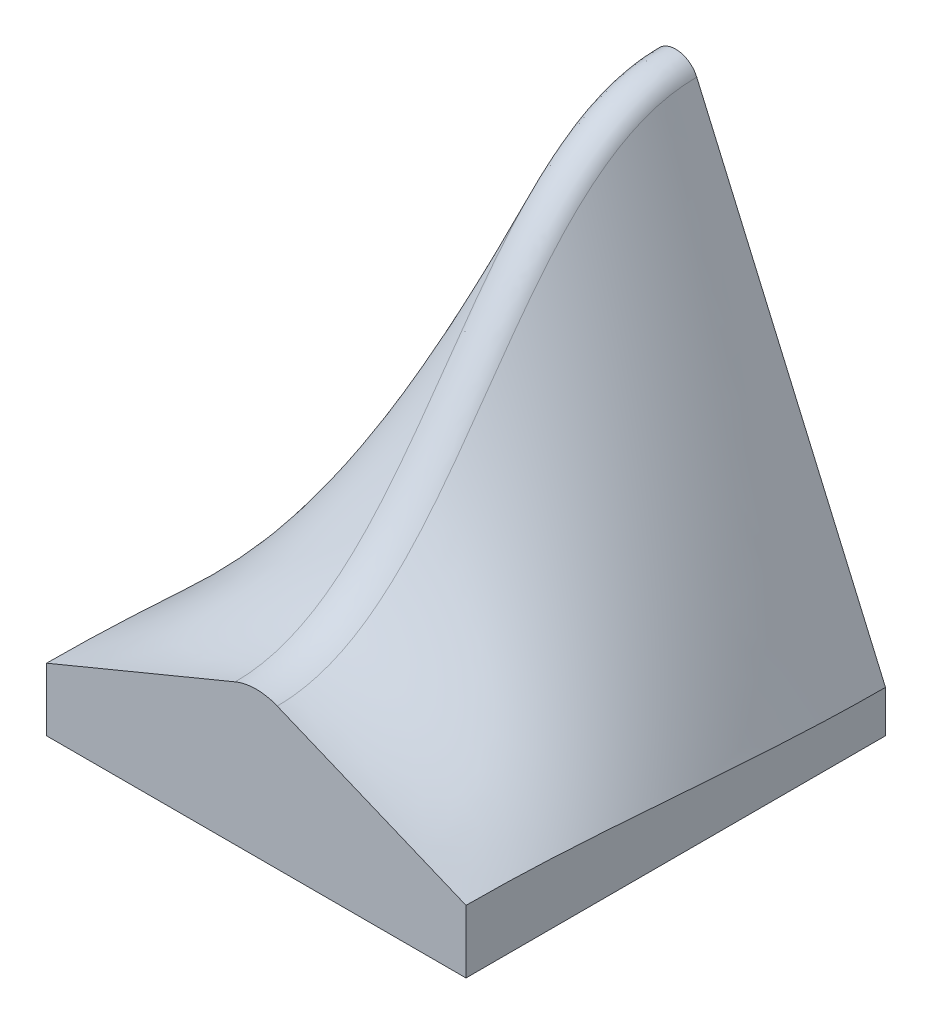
ISO-10303-21;
HEADER;
FILE_DESCRIPTION(('STEP AP214'),'2;1');
FILE_NAME('part.step','',(''),(''),'','','');
FILE_SCHEMA(('AUTOMOTIVE_DESIGN { 1 0 10303 214 1 1 1 1 }'));
ENDSEC;
DATA;
#1=APPLICATION_CONTEXT('core data for automotive mechanical design processes');
#2=APPLICATION_PROTOCOL_DEFINITION('international standard','automotive_design',2000,#1);
#3=PRODUCT_CONTEXT('',#1,'mechanical');
#4=PRODUCT('Part','Part','',(#3));
#5=PRODUCT_RELATED_PRODUCT_CATEGORY('part','',(#4));
#6=PRODUCT_DEFINITION_FORMATION('','',#4);
#7=PRODUCT_DEFINITION_CONTEXT('part definition',#1,'design');
#8=PRODUCT_DEFINITION('design','',#6,#7);
#9=PRODUCT_DEFINITION_SHAPE('','',#8);
#10=(LENGTH_UNIT() NAMED_UNIT(*) SI_UNIT(.MILLI.,.METRE.));
#11=(NAMED_UNIT(*) PLANE_ANGLE_UNIT() SI_UNIT($,.RADIAN.));
#12=(NAMED_UNIT(*) SI_UNIT($,.STERADIAN.) SOLID_ANGLE_UNIT());
#13=UNCERTAINTY_MEASURE_WITH_UNIT(LENGTH_MEASURE(1.E-05),#10,'distance_accuracy_value','');
#14=(GEOMETRIC_REPRESENTATION_CONTEXT(3) GLOBAL_UNCERTAINTY_ASSIGNED_CONTEXT((#13)) GLOBAL_UNIT_ASSIGNED_CONTEXT((#10,
#11,#12)) REPRESENTATION_CONTEXT('',''));
#15=CARTESIAN_POINT('',(0.,0.,0.));
#16=DIRECTION('',(0.,0.,1.));
#17=DIRECTION('',(1.,0.,0.));
#18=AXIS2_PLACEMENT_3D('',#15,#16,#17);
#19=CARTESIAN_POINT('',(2.49999999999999,56.7464573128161,-56.671611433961));
#20=CARTESIAN_POINT('',(2.50000000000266,56.74645731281,-55.5596761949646));
#21=CARTESIAN_POINT('',(2.49999999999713,56.7464573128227,-54.4477409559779));
#22=CARTESIAN_POINT('',(2.50000000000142,56.7464573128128,-52.7798380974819));
#23=CARTESIAN_POINT('',(2.50000000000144,56.7464573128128,-52.2238704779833));
#24=CARTESIAN_POINT('',(2.49999999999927,56.7464573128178,-51.389919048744));
#25=CARTESIAN_POINT('',(2.49999999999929,56.7464573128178,-51.1119352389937));
#26=CARTESIAN_POINT('',(2.50000000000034,56.7464573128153,-50.6949595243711));
#27=CARTESIAN_POINT('',(2.49999999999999,56.7464573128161,-50.5559676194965));
#28=CARTESIAN_POINT('',(2.49999999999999,56.7464573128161,-50.3474797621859));
#29=CARTESIAN_POINT('',(2.49999999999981,56.7464573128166,-50.2779838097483));
#30=CARTESIAN_POINT('',(2.50000000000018,56.7464573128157,-50.1389919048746));
#31=CARTESIAN_POINT('',(2.49999945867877,56.7464585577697,-50.0775606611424));
#32=CARTESIAN_POINT('',(2.50000033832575,56.7464565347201,-49.9515245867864));
#33=CARTESIAN_POINT('',(2.49999999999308,56.7462161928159,-49.8929789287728));
#34=CARTESIAN_POINT('',(2.50000000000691,56.7452497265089,-49.7859938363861));
#35=CARTESIAN_POINT('',(2.49999999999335,56.7445243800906,-49.7325138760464));
#36=CARTESIAN_POINT('',(2.50000000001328,56.741619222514,-49.5721172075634));
#37=CARTESIAN_POINT('',(2.49999999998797,56.7387102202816,-49.4652436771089));
#38=CARTESIAN_POINT('',(2.50000000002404,56.7270468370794,-49.1448407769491));
#39=CARTESIAN_POINT('',(2.49999999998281,56.7153547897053,-48.9315286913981));
#40=CARTESIAN_POINT('',(2.50000000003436,56.6684157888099,-48.2928390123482));
#41=CARTESIAN_POINT('',(2.4999999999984,56.6212827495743,-47.8687069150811));
#42=CARTESIAN_POINT('',(2.50000000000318,56.4322398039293,-46.6044586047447));
#43=CARTESIAN_POINT('',(2.50000000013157,56.2423415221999,-45.7726618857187));
#44=CARTESIAN_POINT('',(2.49999999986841,55.7428424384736,-44.1464165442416));
#45=CARTESIAN_POINT('',(2.50000000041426,55.4308647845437,-43.3471063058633));
#46=CARTESIAN_POINT('',(2.49999999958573,54.7184258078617,-41.8235260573));
#47=CARTESIAN_POINT('',(2.50000000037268,54.319376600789,-41.0989557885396));
#48=CARTESIAN_POINT('',(2.49999999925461,53.029352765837,-39.0235961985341));
#49=CARTESIAN_POINT('',(2.50000000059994,52.0390532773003,-37.7609251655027));
#50=CARTESIAN_POINT('',(2.49999999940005,49.9809381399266,-35.4621026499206));
#51=CARTESIAN_POINT('',(2.5000000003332,48.9115443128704,-34.4205929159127));
#52=CARTESIAN_POINT('',(2.49999999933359,45.6425317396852,-31.4773820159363));
#53=CARTESIAN_POINT('',(2.50000000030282,43.3799543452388,-29.7501940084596));
#54=CARTESIAN_POINT('',(2.49999999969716,38.8403273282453,-26.4341461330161));
#55=CARTESIAN_POINT('',(2.50000000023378,36.5642753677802,-24.8556308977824));
#56=CARTESIAN_POINT('',(2.49999999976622,32.1226816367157,-21.6835028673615));
#57=CARTESIAN_POINT('',(2.50000000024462,29.9561517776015,-20.0923722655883));
#58=CARTESIAN_POINT('',(2.49999999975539,25.886407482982,-16.7588296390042));
#59=CARTESIAN_POINT('',(2.5000000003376,23.9822641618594,-15.0193280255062));
#60=CARTESIAN_POINT('',(2.49999999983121,21.4839902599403,-12.1673994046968));
#61=CARTESIAN_POINT('',(2.50000000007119,20.7052178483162,-11.1664278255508));
#62=CARTESIAN_POINT('',(2.49999999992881,19.332957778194,-9.08727940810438));
#63=CARTESIAN_POINT('',(2.50000000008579,18.7488603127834,-8.02561493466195));
#64=CARTESIAN_POINT('',(2.49999999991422,17.7986225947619,-5.83734246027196));
#65=CARTESIAN_POINT('',(2.49999999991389,17.4310913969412,-4.70705557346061));
#66=CARTESIAN_POINT('',(2.50000000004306,17.0608716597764,-2.94654294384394));
#67=CARTESIAN_POINT('',(2.49999999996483,16.9699188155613,-2.35984044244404));
#68=CARTESIAN_POINT('',(2.50000000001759,16.879514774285,-1.47732174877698));
#69=CARTESIAN_POINT('',(2.49999999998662,16.8570625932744,-1.18274099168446));
#70=CARTESIAN_POINT('',(2.50000000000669,16.8346713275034,-0.739961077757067));
#71=CARTESIAN_POINT('',(2.49999999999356,16.8290893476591,-0.592216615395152));
#72=CARTESIAN_POINT('',(2.50000000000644,16.821656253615,-0.296379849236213));
#73=CARTESIAN_POINT('',(2.49999937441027,16.8198054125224,-0.161330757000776));
#74=CARTESIAN_POINT('',(2.50000050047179,16.8198049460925,0.129064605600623));
#75=CARTESIAN_POINT('',(2.50000000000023,16.8198051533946,0.278998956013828));
#76=CARTESIAN_POINT('',(2.49999999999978,16.8198051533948,0.557997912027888));
#77=CARTESIAN_POINT('',(2.5000000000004,16.8198051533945,0.697497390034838));
#78=CARTESIAN_POINT('',(2.49999999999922,16.819805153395,1.11599582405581));
#79=CARTESIAN_POINT('',(2.49999999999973,16.8198051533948,1.39499478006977));
#80=CARTESIAN_POINT('',(2.50000000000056,16.8198051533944,2.23199164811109));
#81=CARTESIAN_POINT('',(2.50000000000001,16.8198051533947,2.78998956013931));
#82=CARTESIAN_POINT('',(2.50000000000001,16.8198051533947,4.46398329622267));
#83=CARTESIAN_POINT('',(2.50000000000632,16.819805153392,5.57997912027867));
#84=CARTESIAN_POINT('',(2.5,16.8198051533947,6.69597494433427));
#85=CARTESIAN_POINT('',(0.,62.4960636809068,-56.671611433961));
#86=CARTESIAN_POINT('',(1.25378510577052E-11,62.4960636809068,-55.559676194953));
#87=CARTESIAN_POINT('',(-3.87167811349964E-12,62.4960636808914,-54.4477409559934));
#88=CARTESIAN_POINT('',(1.91502237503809E-12,62.4960636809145,-52.7798380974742));
#89=CARTESIAN_POINT('',(4.80663789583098E-12,62.4960636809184,-52.2238704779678));
#90=CARTESIAN_POINT('',(-2.42673771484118E-12,62.496063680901,-51.3899190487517));
#91=CARTESIAN_POINT('',(-1.70340015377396E-12,62.4960636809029,-51.1119352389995));
#92=CARTESIAN_POINT('',(8.28281309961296E-13,62.4960636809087,-50.6949595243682));
#93=CARTESIAN_POINT('',(0.,62.4960636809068,-50.5559676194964));
#94=CARTESIAN_POINT('',(0.,62.4960636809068,-50.3474797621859));
#95=CARTESIAN_POINT('',(-4.9783755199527E-13,62.4960636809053,-50.2779838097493));
#96=CARTESIAN_POINT('',(4.66612529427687E-13,62.4960636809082,-50.1389919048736));
#97=CARTESIAN_POINT('',(-5.5985045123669E-13,62.4960662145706,-50.0913767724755));
#98=CARTESIAN_POINT('',(3.21717229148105E-13,62.4960620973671,-49.9428895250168));
#99=CARTESIAN_POINT('',(3.69315069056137E-13,62.4956510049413,-49.8583975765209));
#100=CARTESIAN_POINT('',(-3.83172063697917E-13,62.4939932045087,-49.716708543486));
#101=CARTESIAN_POINT('',(0.,62.4927481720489,-49.6458401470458));
#102=CARTESIAN_POINT('',(0.,62.4877548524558,-49.4331849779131));
#103=CARTESIAN_POINT('',(-1.12493632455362E-12,62.4827489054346,-49.2913485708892));
#104=CARTESIAN_POINT('',(2.24835001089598E-12,62.4626311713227,-48.8658435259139));
#105=CARTESIAN_POINT('',(-1.32298675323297E-12,62.442428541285,-48.5821841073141));
#106=CARTESIAN_POINT('',(2.70618007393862E-12,62.3610684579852,-47.7329451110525));
#107=CARTESIAN_POINT('',(5.79467089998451E-13,62.2793054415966,-47.1691681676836));
#108=CARTESIAN_POINT('',(-1.19741507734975E-12,61.9514823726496,-45.4992752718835));
#109=CARTESIAN_POINT('',(1.20199064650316E-12,61.6253133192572,-44.4149663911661));
#110=CARTESIAN_POINT('',(-1.18298640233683E-12,60.7777296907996,-42.3398767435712));
#111=CARTESIAN_POINT('',(2.76213574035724E-12,60.2643165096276,-41.3554624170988));
#112=CARTESIAN_POINT('',(-2.63781377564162E-12,59.1266736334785,-39.5423893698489));
#113=CARTESIAN_POINT('',(2.42197630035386E-12,58.514470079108,-38.7158837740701));
#114=CARTESIAN_POINT('',(-4.57612154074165E-12,56.6470313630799,-36.4821838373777));
#115=CARTESIAN_POINT('',(-6.2965454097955E-13,55.2929642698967,-35.1905924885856));
#116=CARTESIAN_POINT('',(5.65076383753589E-13,52.6349004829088,-32.9461197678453));
#117=CARTESIAN_POINT('',(3.05913973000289E-12,51.324411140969,-31.963031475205));
#118=CARTESIAN_POINT('',(-5.51622078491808E-12,47.6027441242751,-29.3457389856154));
#119=CARTESIAN_POINT('',(-3.12736692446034E-12,45.0574386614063,-27.7583489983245));
#120=CARTESIAN_POINT('',(2.83625068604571E-12,40.1661894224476,-24.7689355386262));
#121=CARTESIAN_POINT('',(-1.23031213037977E-12,37.7430275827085,-23.3185678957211));
#122=CARTESIAN_POINT('',(1.15573172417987E-12,33.1432349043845,-20.4145143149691));
#123=CARTESIAN_POINT('',(-1.20646142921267E-12,30.9017046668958,-18.9293240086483));
#124=CARTESIAN_POINT('',(1.17068436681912E-12,26.7809303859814,-15.8158331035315));
#125=CARTESIAN_POINT('',(6.66896588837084E-12,24.8530188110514,-14.1660124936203));
#126=CARTESIAN_POINT('',(-3.28450923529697E-12,22.3686458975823,-11.4587237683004));
#127=CARTESIAN_POINT('',(-1.68421271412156E-12,21.601461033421,-10.5102381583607));
#128=CARTESIAN_POINT('',(1.68123091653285E-12,20.2628698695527,-8.54548214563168));
#129=CARTESIAN_POINT('',(4.5381619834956E-12,19.6975235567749,-7.54240033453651));
#130=CARTESIAN_POINT('',(-4.52104179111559E-12,18.7854033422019,-5.48298503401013));
#131=CARTESIAN_POINT('',(-3.05086342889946E-13,18.435490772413,-4.42123289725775));
#132=CARTESIAN_POINT('',(1.57334170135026E-13,18.0839362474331,-2.76903328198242));
#133=CARTESIAN_POINT('',(1.67165354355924E-12,17.9977115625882,-2.21849080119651));
#134=CARTESIAN_POINT('',(-8.33454045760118E-13,17.9119872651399,-1.38962066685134));
#135=CARTESIAN_POINT('',(-3.37680907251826E-13,17.8906935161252,-1.1128180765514));
#136=CARTESIAN_POINT('',(1.73064319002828E-13,17.8694504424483,-0.696462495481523));
#137=CARTESIAN_POINT('',(6.44071176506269E-13,17.8641530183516,-0.557485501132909));
#138=CARTESIAN_POINT('',(-6.41463567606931E-13,17.8570973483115,-0.279089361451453));
#139=CARTESIAN_POINT('',(0.,17.8553407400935,-0.157021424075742));
#140=CARTESIAN_POINT('',(0.,17.8553377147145,0.125617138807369));
#141=CARTESIAN_POINT('',(3.64290571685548E-13,17.8553390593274,0.278998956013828));
#142=CARTESIAN_POINT('',(-3.61688486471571E-13,17.8553390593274,0.557997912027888));
#143=CARTESIAN_POINT('',(1.24465956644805E-13,17.8553390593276,0.697497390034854));
#144=CARTESIAN_POINT('',(-2.38523572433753E-13,17.8553390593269,1.11599582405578));
#145=CARTESIAN_POINT('',(0.,17.8553390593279,1.39499478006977));
#146=CARTESIAN_POINT('',(1.89084179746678E-13,17.8553390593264,2.23199164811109));
#147=CARTESIAN_POINT('',(-2.9598606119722E-13,17.8553390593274,2.78998956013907));
#148=CARTESIAN_POINT('',(6.11487761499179E-13,17.8553390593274,4.46398329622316));
#149=CARTESIAN_POINT('',(-9.06910037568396E-12,17.8553390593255,5.57997912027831));
#150=CARTESIAN_POINT('',(0.,17.8553390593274,6.69597494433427));
#151=CARTESIAN_POINT('',(-2.50000000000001,56.7464573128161,-56.671611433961));
#152=CARTESIAN_POINT('',(-2.49999999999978,56.7464573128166,-55.5596761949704));
#153=CARTESIAN_POINT('',(-2.50000000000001,56.7464573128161,-54.4477409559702));
#154=CARTESIAN_POINT('',(-2.50000000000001,56.7464573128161,-52.7798380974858));
#155=CARTESIAN_POINT('',(-2.50000000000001,56.7464573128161,-52.2238704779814));
#156=CARTESIAN_POINT('',(-2.50000000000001,56.7464573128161,-51.389919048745));
#157=CARTESIAN_POINT('',(-2.50000000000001,56.7464573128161,-51.1119352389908));
#158=CARTESIAN_POINT('',(-2.50000000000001,56.7464573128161,-50.6949595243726));
#159=CARTESIAN_POINT('',(-2.50000000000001,56.7464573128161,-50.5559676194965));
#160=CARTESIAN_POINT('',(-2.50000000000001,56.7464573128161,-50.3474797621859));
#161=CARTESIAN_POINT('',(-2.50000000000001,56.7464573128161,-50.2779838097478));
#162=CARTESIAN_POINT('',(-2.50000000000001,56.7464573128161,-50.1389919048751));
#163=CARTESIAN_POINT('',(-2.49999945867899,56.7464585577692,-50.0775606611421));
#164=CARTESIAN_POINT('',(-2.50000033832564,56.7464565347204,-49.9515245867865));
#165=CARTESIAN_POINT('',(-2.49999999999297,56.7462161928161,-49.8929789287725));
#166=CARTESIAN_POINT('',(-2.50000000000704,56.7452497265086,-49.7859938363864));
#167=CARTESIAN_POINT('',(-2.49999999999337,56.7445243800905,-49.7325138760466));
#168=CARTESIAN_POINT('',(-2.50000000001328,56.741619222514,-49.572117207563));
#169=CARTESIAN_POINT('',(-2.49999999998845,56.7387102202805,-49.4652436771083));
#170=CARTESIAN_POINT('',(-2.50000000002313,56.7270468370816,-49.1448407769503));
#171=CARTESIAN_POINT('',(-2.4999999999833,56.715354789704,-48.9315286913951));
#172=CARTESIAN_POINT('',(-2.50000000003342,56.6684157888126,-48.2928390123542));
#173=CARTESIAN_POINT('',(-2.49999999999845,56.6212827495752,-47.8687069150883));
#174=CARTESIAN_POINT('',(-2.50000000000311,56.4322398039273,-46.6044586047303));
#175=CARTESIAN_POINT('',(-2.50000000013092,56.2423415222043,-45.7726618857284));
#176=CARTESIAN_POINT('',(-2.49999999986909,55.7428424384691,-44.146416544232));
#177=CARTESIAN_POINT('',(-2.50000000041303,55.4308647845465,-43.3471063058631));
#178=CARTESIAN_POINT('',(-2.49999999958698,54.718425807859,-41.8235260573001));
#179=CARTESIAN_POINT('',(-2.50000000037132,54.319376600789,-41.0989557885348));
#180=CARTESIAN_POINT('',(-2.49999999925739,53.0293527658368,-39.0235961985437));
#181=CARTESIAN_POINT('',(-2.50000000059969,52.0390532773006,-37.7609251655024));
#182=CARTESIAN_POINT('',(-2.49999999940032,49.9809381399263,-35.4621026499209));
#183=CARTESIAN_POINT('',(-2.5000000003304,48.9115443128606,-34.4205929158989));
#184=CARTESIAN_POINT('',(-2.49999999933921,45.6425317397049,-31.4773820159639));
#185=CARTESIAN_POINT('',(-2.50000000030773,43.379954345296,-29.7501940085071));
#186=CARTESIAN_POINT('',(-2.49999999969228,38.8403273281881,-26.4341461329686));
#187=CARTESIAN_POINT('',(-2.50000000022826,36.56427536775,-24.855630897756));
#188=CARTESIAN_POINT('',(-2.49999999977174,32.1226816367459,-21.6835028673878));
#189=CARTESIAN_POINT('',(-2.50000000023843,29.9561517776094,-20.0923722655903));
#190=CARTESIAN_POINT('',(-2.49999999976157,25.8864074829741,-16.7588296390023));
#191=CARTESIAN_POINT('',(-2.5000000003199,23.9822641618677,-15.0193280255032));
#192=CARTESIAN_POINT('',(-2.49999999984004,21.4839902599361,-12.1673994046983));
#193=CARTESIAN_POINT('',(-2.50000000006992,20.7052178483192,-11.1664278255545));
#194=CARTESIAN_POINT('',(-2.49999999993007,19.3329577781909,-9.08727940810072));
#195=CARTESIAN_POINT('',(-2.50000000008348,18.7488603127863,-8.02561493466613));
#196=CARTESIAN_POINT('',(-2.49999999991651,17.7986225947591,-5.83734246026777));
#197=CARTESIAN_POINT('',(-2.49999999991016,17.4310913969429,-4.70705557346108));
#198=CARTESIAN_POINT('',(-2.50000000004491,17.0608716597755,-2.9465429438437));
#199=CARTESIAN_POINT('',(-2.49999999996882,16.9699188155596,-2.35984044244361));
#200=CARTESIAN_POINT('',(-2.50000000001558,16.8795147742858,-1.4773217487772));
#201=CARTESIAN_POINT('',(-2.49999999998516,16.857062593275,-1.1827409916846));
#202=CARTESIAN_POINT('',(-2.50000000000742,16.8346713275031,-0.739961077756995));
#203=CARTESIAN_POINT('',(-2.49999999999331,16.8290893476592,-0.592216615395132));
#204=CARTESIAN_POINT('',(-2.50000000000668,16.8216562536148,-0.296379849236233));
#205=CARTESIAN_POINT('',(-2.49999937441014,16.8198054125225,-0.161330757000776));
#206=CARTESIAN_POINT('',(-2.50000050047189,16.8198049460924,0.129064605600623));
#207=CARTESIAN_POINT('',(-2.4999999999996,16.8198051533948,0.278998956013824));
#208=CARTESIAN_POINT('',(-2.50000000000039,16.8198051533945,0.557997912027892));
#209=CARTESIAN_POINT('',(-2.49999999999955,16.8198051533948,0.697497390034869));
#210=CARTESIAN_POINT('',(-2.50000000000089,16.8198051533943,1.11599582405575));
#211=CARTESIAN_POINT('',(-2.50000000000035,16.8198051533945,1.39499478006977));
#212=CARTESIAN_POINT('',(-2.49999999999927,16.819805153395,2.23199164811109));
#213=CARTESIAN_POINT('',(-2.50000000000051,16.8198051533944,2.78998956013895));
#214=CARTESIAN_POINT('',(-2.49999999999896,16.8198051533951,4.4639832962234));
#215=CARTESIAN_POINT('',(-2.49999999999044,16.8198051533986,5.57997912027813));
#216=CARTESIAN_POINT('',(-2.5,16.8198051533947,6.69597494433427));
#217=(BOUNDED_SURFACE() B_SPLINE_SURFACE(2,3,((#19,#20,#21,#22,#23,#24,#25,#26,#27,#28,#29,#30,
#31,#32,#33,#34,#35,#36,#37,#38,#39,#40,#41,#42,#43,#44,#45,#46,#47,#48,#49,#50,#51,#52,#53,#54,
#55,#56,#57,#58,#59,#60,#61,#62,#63,#64,#65,#66,#67,#68,#69,#70,#71,#72,#73,#74,#75,#76,#77,#78,
#79,#80,#81,#82,#83,#84),(#85,#86,#87,#88,#89,#90,#91,#92,#93,#94,#95,#96,#97,#98,#99,#100,#101,
#102,#103,#104,#105,#106,#107,#108,#109,#110,#111,#112,#113,#114,#115,#116,#117,#118,#119,#120,
#121,#122,#123,#124,#125,#126,#127,#128,#129,#130,#131,#132,#133,#134,#135,#136,#137,#138,#139,
#140,#141,#142,#143,#144,#145,#146,#147,#148,#149,#150),(#151,#152,#153,#154,#155,#156,#157,
#158,#159,#160,#161,#162,#163,#164,#165,#166,#167,#168,#169,#170,#171,#172,#173,#174,#175,#176,
#177,#178,#179,#180,#181,#182,#183,#184,#185,#186,#187,#188,#189,#190,#191,#192,#193,#194,#195,
#196,#197,#198,#199,#200,#201,#202,#203,#204,#205,#206,#207,#208,#209,#210,#211,#212,#213,#214,
#215,#216)),.UNSPECIFIED.,.F.,.F.,.F.) B_SPLINE_SURFACE_WITH_KNOTS((3,3),(4,2,2,2,2,2,2,2,2,2,2,
2,2,2,2,2,2,2,2,2,2,2,2,2,2,2,2,2,2,2,2,2,4),(0.,1.),(0.0219464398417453,0.0252822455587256,
0.0269501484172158,0.0277840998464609,0.0282010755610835,0.0284095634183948,0.028618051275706,
0.0287483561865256,0.0288786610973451,0.0291392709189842,0.0296604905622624,0.0307029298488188,
0.0327878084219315,0.0348726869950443,0.036957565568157,0.0411273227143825,0.045297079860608,
0.0536365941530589,0.0619761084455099,0.0703156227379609,0.0786551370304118,0.0828248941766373,
0.0869946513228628,0.0911644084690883,0.093249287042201,0.0942917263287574,0.0948129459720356,
0.0953341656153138,0.0957511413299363,0.0961681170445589,0.097002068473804,0.0986699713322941,
0.102005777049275),
.UNSPECIFIED.) GEOMETRIC_REPRESENTATION_ITEM() RATIONAL_B_SPLINE_SURFACE(((1.,1.,1.,1.,1.,1.,1.,
1.,1.,1.,1.,1.,1.,1.,1.,1.,1.,1.,1.,1.,1.,1.,1.,1.,1.,1.,1.,1.,1.,1.,1.,1.,1.,1.,1.,1.,1.,1.,1.,
1.,1.,1.,1.,1.,1.,1.,1.,1.,1.,1.,1.,1.,1.,1.,1.,1.,1.,1.,1.,1.,1.,1.,1.,1.,1.,1.),
(0.398749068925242,0.398749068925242,0.398749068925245,0.398749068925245,0.398749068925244,
0.398749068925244,0.398749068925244,0.398749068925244,0.398749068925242,0.398749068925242,
0.398749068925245,0.398749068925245,0.398749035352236,0.398749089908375,0.398754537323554,
0.39877657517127,0.398793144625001,0.398859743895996,0.398926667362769,0.399196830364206,
0.399469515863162,0.400578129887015,0.401705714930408,0.406321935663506,0.411064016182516,
0.423788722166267,0.431829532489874,0.450151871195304,0.46038876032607,0.492961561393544,
0.517246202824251,0.564732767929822,0.588027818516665,0.654509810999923,0.69426130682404,
0.762625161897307,0.791331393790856,0.83903191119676,0.858067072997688,0.888171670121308,
0.899241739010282,0.910947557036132,0.914049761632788,0.918743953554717,0.920317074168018,
0.922476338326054,0.923070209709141,0.92359686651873,0.923707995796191,0.923814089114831,
0.923839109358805,0.923863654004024,0.923869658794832,0.923877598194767,0.92387953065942,
0.923879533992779,0.923879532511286,0.923879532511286,0.923879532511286,0.923879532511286,
0.923879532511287,0.923879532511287,0.923879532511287,0.923879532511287,0.923879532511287,
0.923879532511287),(1.,1.,1.,1.,1.,1.,1.,1.,1.,1.,1.,1.,1.,1.,1.,1.,1.,1.,1.,1.,1.,1.,1.,1.,1.,
1.,1.,1.,1.,1.,1.,1.,1.,1.,1.,1.,1.,1.,1.,1.,1.,1.,1.,1.,1.,1.,1.,1.,1.,1.,1.,1.,1.,1.,1.,1.,1.,
1.,1.,1.,1.,1.,1.,1.,1.,1.))) REPRESENTATION_ITEM('') SURFACE());
#218=CARTESIAN_POINT('',(2.49999999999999,56.7464573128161,-50.0000000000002));
#219=CARTESIAN_POINT('',(2.49999999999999,56.7464573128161,-28.2227584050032));
#220=CARTESIAN_POINT('',(2.5,16.8198051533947,-21.777241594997));
#221=CARTESIAN_POINT('',(2.5,16.8198051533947,0.));
#222=B_SPLINE_CURVE_WITH_KNOTS('',3,(#218,#219,#220,#221),.UNSPECIFIED.,.F.,.F.,(4,4),(0.,1.),.UNSPECIFIED.);
#223=CARTESIAN_POINT('',(2.49999999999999,56.7464573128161,-50.0000000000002));
#224=VERTEX_POINT('',#223);
#225=CARTESIAN_POINT('',(2.5,16.8198051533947,0.));
#226=VERTEX_POINT('',#225);
#227=EDGE_CURVE('E357',#224,#226,#222,.T.);
#228=CARTESIAN_POINT('',(-2.50000000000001,56.7464573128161,-50.0000000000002));
#229=CARTESIAN_POINT('',(-2.46943292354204,56.8167751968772,-50.0000000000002));
#230=CARTESIAN_POINT('',(-2.43588727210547,56.885794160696,-50.0000000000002));
#231=CARTESIAN_POINT('',(-2.36310690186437,57.0207602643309,-50.0000000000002));
#232=CARTESIAN_POINT('',(-2.32387245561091,57.0867075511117,-50.0000000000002));
#233=CARTESIAN_POINT('',(-2.24000939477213,57.2150175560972,-50.0000000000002));
#234=CARTESIAN_POINT('',(-2.19538463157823,57.2773827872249,-50.0000000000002));
#235=CARTESIAN_POINT('',(-2.10106018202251,57.3981211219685,-50.0000000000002));
#236=CARTESIAN_POINT('',(-2.05136055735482,57.456494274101,-50.0000000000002));
#237=CARTESIAN_POINT('',(-1.89509847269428,57.6250465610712,-50.0000000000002));
#238=CARTESIAN_POINT('',(-1.78133724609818,57.7287128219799,-50.0000000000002));
#239=CARTESIAN_POINT('',(-1.53810661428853,57.9153956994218,-50.0000000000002));
#240=CARTESIAN_POINT('',(-1.40864018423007,57.9984162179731,-50.0000000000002));
#241=CARTESIAN_POINT('',(-1.13758821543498,58.1415635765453,-50.0000000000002));
#242=CARTESIAN_POINT('',(-0.99600234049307,58.2016897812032,-50.0000000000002));
#243=CARTESIAN_POINT('',(-0.704730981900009,58.2973223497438,-50.0000000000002));
#244=CARTESIAN_POINT('',(-0.555044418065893,58.3328254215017,-50.0000000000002));
#245=CARTESIAN_POINT('',(-0.251843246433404,58.378195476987,-50.0000000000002));
#246=CARTESIAN_POINT('',(-0.0983288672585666,58.3880639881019,-50.0000000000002));
#247=CARTESIAN_POINT('',(0.208175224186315,58.3818876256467,-50.0000000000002));
#248=CARTESIAN_POINT('',(0.361164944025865,58.3658431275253,-50.0000000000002));
#249=CARTESIAN_POINT('',(0.662285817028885,58.3082961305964,-50.0000000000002));
#250=CARTESIAN_POINT('',(0.810416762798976,58.2667925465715,-50.0000000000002));
#251=CARTESIAN_POINT('',(1.0975978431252,58.1595082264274,-50.0000000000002));
#252=CARTESIAN_POINT('',(1.23664861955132,58.0937292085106,-50.0000000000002));
#253=CARTESIAN_POINT('',(1.50173986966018,57.9397575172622,-50.0000000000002));
#254=CARTESIAN_POINT('',(1.6277796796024,57.8515637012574,-50.0000000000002));
#255=CARTESIAN_POINT('',(1.86326234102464,57.6552683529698,-50.0000000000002));
#256=CARTESIAN_POINT('',(1.97270571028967,57.5471674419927,-50.0000000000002));
#257=CARTESIAN_POINT('',(2.16002324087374,57.32800791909,-50.0000000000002));
#258=CARTESIAN_POINT('',(2.24010472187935,57.2188342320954,-50.0000000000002));
#259=CARTESIAN_POINT('',(2.34740444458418,57.0471921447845,-50.0000000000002));
#260=CARTESIAN_POINT('',(2.38103887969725,56.9886531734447,-50.0000000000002));
#261=CARTESIAN_POINT('',(2.44387974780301,56.8692358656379,-50.0000000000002));
#262=CARTESIAN_POINT('',(2.47308564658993,56.8083572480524,-50.0000000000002));
#263=CARTESIAN_POINT('',(2.49999999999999,56.7464573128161,-50.0000000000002));
#264=B_SPLINE_CURVE_WITH_KNOTS('',3,(#228,#229,#230,#231,#232,#233,#234,#235,#236,#237,#238,
#239,#240,#241,#242,#243,#244,#245,#246,#247,#248,#249,#250,#251,#252,#253,#254,#255,#256,#257,
#258,#259,#260,#261,#262,#263),.UNSPECIFIED.,.F.,.F.,(4,2,2,2,2,2,2,2,2,2,2,2,2,2,2,2,2,4),(0.,
0.229948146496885,0.459885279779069,0.689659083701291,0.919430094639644,1.37877986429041,
1.83804275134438,2.29731838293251,2.75665540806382,3.21596506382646,3.67526806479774,
4.13459064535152,4.59388072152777,5.05319421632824,5.51249337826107,5.9171016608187,
6.11947933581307,6.32188140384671),.UNSPECIFIED.);
#265=CARTESIAN_POINT('',(-2.50000000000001,56.7464573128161,-50.0000000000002));
#266=VERTEX_POINT('',#265);
#267=EDGE_CURVE('E107',#266,#224,#264,.T.);
#268=CARTESIAN_POINT('',(-2.5,16.8198051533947,0.));
#269=CARTESIAN_POINT('',(-2.5,16.8198051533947,-21.777241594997));
#270=CARTESIAN_POINT('',(-2.50000000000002,56.7464573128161,-28.2227584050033));
#271=CARTESIAN_POINT('',(-2.50000000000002,56.7464573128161,-50.0000000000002));
#272=B_SPLINE_CURVE_WITH_KNOTS('',3,(#268,#269,#270,#271),.UNSPECIFIED.,.F.,.F.,(4,4),(0.,1.),.UNSPECIFIED.);
#273=CARTESIAN_POINT('',(-2.5,16.8198051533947,0.));
#274=VERTEX_POINT('',#273);
#275=EDGE_CURVE('E359',#274,#266,#272,.T.);
#276=CARTESIAN_POINT('',(2.5,16.8198051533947,0.));
#277=CARTESIAN_POINT('',(2.33038090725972,16.8900849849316,0.));
#278=CARTESIAN_POINT('',(2.15778776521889,16.9531771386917,0.));
#279=CARTESIAN_POINT('',(1.80790766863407,17.0646198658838,0.));
#280=CARTESIAN_POINT('',(1.63062076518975,17.1129705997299,0.));
#281=CARTESIAN_POINT('',(1.27247306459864,17.1945955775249,0.));
#282=CARTESIAN_POINT('',(1.09160975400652,17.2278587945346,0.));
#283=CARTESIAN_POINT('',(0.727732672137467,17.2790248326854,0.));
#284=CARTESIAN_POINT('',(0.54471900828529,17.296928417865,0.));
#285=CARTESIAN_POINT('',(0.177704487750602,17.3172563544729,0.));
#286=CARTESIAN_POINT('',(-0.00629697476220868,17.3196697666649,0.));
#287=CARTESIAN_POINT('',(-0.373848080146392,17.3089710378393,0.));
#288=CARTESIAN_POINT('',(-0.557397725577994,17.2958589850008,0.));
#289=CARTESIAN_POINT('',(-0.922402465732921,17.254242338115,0.));
#290=CARTESIAN_POINT('',(-1.10386075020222,17.2257656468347,0.));
#291=CARTESIAN_POINT('',(-1.46366449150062,17.1536508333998,0.));
#292=CARTESIAN_POINT('',(-1.64201141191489,17.1100200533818,0.));
#293=CARTESIAN_POINT('',(-1.93398806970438,17.0254173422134,0.));
#294=CARTESIAN_POINT('',(-2.04885580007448,16.9886559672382,0.));
#295=CARTESIAN_POINT('',(-2.27623496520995,16.9088876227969,0.));
#296=CARTESIAN_POINT('',(-2.38874925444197,16.8658887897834,0.));
#297=CARTESIAN_POINT('',(-2.5,16.8198051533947,0.));
#298=B_SPLINE_CURVE_WITH_KNOTS('',3,(#276,#277,#278,#279,#280,#281,#282,#283,#284,#285,#286,
#287,#288,#289,#290,#291,#292,#293,#294,#295,#296,#297),.UNSPECIFIED.,.F.,.F.,(4,2,2,2,2,2,2,2,
2,2,4),(0.,0.55063951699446,1.10127304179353,1.65230835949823,2.20331626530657,2.75471325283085,
3.30610710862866,3.85650296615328,4.40663252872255,4.76828112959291,5.12946215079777),.UNSPECIFIED.);
#299=EDGE_CURVE('E12',#226,#274,#298,.T.);
#300=ORIENTED_EDGE('',*,*,#227,.F.);
#301=ORIENTED_EDGE('',*,*,#267,.F.);
#302=ORIENTED_EDGE('',*,*,#275,.F.);
#303=ORIENTED_EDGE('',*,*,#299,.F.);
#304=EDGE_LOOP('',(#300,#301,#302,#303));
#305=FACE_BOUND('',#304,.T.);
#306=ADVANCED_FACE('F94',(#305),#217,.T.);
#307=CARTESIAN_POINT('',(0.,0.,-50.0000000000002));
#308=DIRECTION('',(0.,0.,1.));
#309=DIRECTION('',(1.,0.,0.));
#310=AXIS2_PLACEMENT_3D('',#307,#308,#309);
#311=PLANE('',#310);
#312=DIRECTION('',(-0.398749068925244,-0.917060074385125,0.));
#313=VECTOR('',#312,1.);
#314=CARTESIAN_POINT('',(-25.,5.,-50.0000000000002));
#315=LINE('',#314,#313);
#316=CARTESIAN_POINT('',(-25.,5.,-50.0000000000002));
#317=VERTEX_POINT('',#316);
#318=EDGE_CURVE('E182',#266,#317,#315,.T.);
#319=ORIENTED_EDGE('',*,*,#318,.F.);
#320=ORIENTED_EDGE('',*,*,#267,.T.);
#321=DIRECTION('',(-0.398749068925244,0.917060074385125,0.));
#322=VECTOR('',#321,1.);
#323=CARTESIAN_POINT('',(0.,62.4960636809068,-50.0000000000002));
#324=LINE('',#323,#322);
#325=CARTESIAN_POINT('',(25.,5.00000000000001,-50.0000000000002));
#326=VERTEX_POINT('',#325);
#327=EDGE_CURVE('E353',#326,#224,#324,.T.);
#328=ORIENTED_EDGE('',*,*,#327,.F.);
#329=DIRECTION('',(0.,1.,0.));
#330=VECTOR('',#329,1.);
#331=CARTESIAN_POINT('',(25.,5.00000000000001,-50.0000000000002));
#332=LINE('',#331,#330);
#333=CARTESIAN_POINT('',(25.,0.,-50.0000000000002));
#334=VERTEX_POINT('',#333);
#335=EDGE_CURVE('E249',#334,#326,#332,.T.);
#336=ORIENTED_EDGE('',*,*,#335,.F.);
#337=DIRECTION('',(1.,0.,0.));
#338=VECTOR('',#337,1.);
#339=CARTESIAN_POINT('',(-25.,0.,-50.0000000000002));
#340=LINE('',#339,#338);
#341=CARTESIAN_POINT('',(-25.,0.,-50.0000000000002));
#342=VERTEX_POINT('',#341);
#343=EDGE_CURVE('E396',#342,#334,#340,.T.);
#344=ORIENTED_EDGE('',*,*,#343,.F.);
#345=DIRECTION('',(0.,-1.,0.));
#346=VECTOR('',#345,1.);
#347=CARTESIAN_POINT('',(-25.,5.,-50.0000000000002));
#348=LINE('',#347,#346);
#349=EDGE_CURVE('E187',#317,#342,#348,.T.);
#350=ORIENTED_EDGE('',*,*,#349,.F.);
#351=EDGE_LOOP('',(#319,#320,#328,#336,#344,#350));
#352=FACE_BOUND('',#351,.T.);
#353=ADVANCED_FACE('F222',(#352),#311,.F.);
#354=CARTESIAN_POINT('',(0.,0.,0.));
#355=DIRECTION('',(0.,0.,1.));
#356=DIRECTION('',(1.,0.,0.));
#357=AXIS2_PLACEMENT_3D('',#354,#355,#356);
#358=PLANE('',#357);
#359=DIRECTION('',(0.923879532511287,-0.382683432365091,0.));
#360=VECTOR('',#359,1.);
#361=CARTESIAN_POINT('',(0.,17.8553390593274,0.));
#362=LINE('',#361,#360);
#363=CARTESIAN_POINT('',(25.,7.5,0.));
#364=VERTEX_POINT('',#363);
#365=EDGE_CURVE('E162',#226,#364,#362,.T.);
#366=ORIENTED_EDGE('',*,*,#365,.F.);
#367=ORIENTED_EDGE('',*,*,#299,.T.);
#368=DIRECTION('',(0.923879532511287,0.382683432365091,0.));
#369=VECTOR('',#368,1.);
#370=CARTESIAN_POINT('',(-25.,7.5,0.));
#371=LINE('',#370,#369);
#372=CARTESIAN_POINT('',(-25.,7.5,0.));
#373=VERTEX_POINT('',#372);
#374=EDGE_CURVE('E151',#373,#274,#371,.T.);
#375=ORIENTED_EDGE('',*,*,#374,.F.);
#376=DIRECTION('',(0.,1.,0.));
#377=VECTOR('',#376,1.);
#378=CARTESIAN_POINT('',(-25.,7.5,0.));
#379=LINE('',#378,#377);
#380=CARTESIAN_POINT('',(-25.,0.,0.));
#381=VERTEX_POINT('',#380);
#382=EDGE_CURVE('E156',#381,#373,#379,.T.);
#383=ORIENTED_EDGE('',*,*,#382,.F.);
#384=DIRECTION('',(-1.,0.,0.));
#385=VECTOR('',#384,1.);
#386=CARTESIAN_POINT('',(-25.,0.,0.));
#387=LINE('',#386,#385);
#388=CARTESIAN_POINT('',(25.,0.,0.));
#389=VERTEX_POINT('',#388);
#390=EDGE_CURVE('E176',#389,#381,#387,.T.);
#391=ORIENTED_EDGE('',*,*,#390,.F.);
#392=DIRECTION('',(0.,-1.,0.));
#393=VECTOR('',#392,1.);
#394=CARTESIAN_POINT('',(25.,7.5,0.));
#395=LINE('',#394,#393);
#396=EDGE_CURVE('E361',#364,#389,#395,.T.);
#397=ORIENTED_EDGE('',*,*,#396,.F.);
#398=EDGE_LOOP('',(#366,#367,#375,#383,#391,#397));
#399=FACE_BOUND('',#398,.T.);
#400=ADVANCED_FACE('F154',(#399),#358,.T.);
#401=CARTESIAN_POINT('',(25.,0.,0.));
#402=DIRECTION('',(0.,-1.,0.));
#403=DIRECTION('',(-1.,0.,0.));
#404=AXIS2_PLACEMENT_3D('',#401,#402,#403);
#405=PLANE('',#404);
#406=ORIENTED_EDGE('',*,*,#390,.T.);
#407=DIRECTION('',(0.,0.,-1.));
#408=VECTOR('',#407,1.);
#409=CARTESIAN_POINT('',(-25.,0.,-25.0000000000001));
#410=LINE('',#409,#408);
#411=EDGE_CURVE('E175',#381,#342,#410,.T.);
#412=ORIENTED_EDGE('',*,*,#411,.T.);
#413=ORIENTED_EDGE('',*,*,#343,.T.);
#414=DIRECTION('',(0.,0.,1.));
#415=VECTOR('',#414,1.);
#416=CARTESIAN_POINT('',(25.,0.,-25.0000000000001));
#417=LINE('',#416,#415);
#418=EDGE_CURVE('E161',#334,#389,#417,.T.);
#419=ORIENTED_EDGE('',*,*,#418,.T.);
#420=EDGE_LOOP('',(#406,#412,#413,#419));
#421=FACE_BOUND('',#420,.T.);
#422=ADVANCED_FACE('F285',(#421),#405,.T.);
#423=CARTESIAN_POINT('',(-25.,0.,0.));
#424=DIRECTION('',(-1.,0.,0.));
#425=DIRECTION('',(0.,1.,0.));
#426=AXIS2_PLACEMENT_3D('',#423,#424,#425);
#427=PLANE('',#426);
#428=ORIENTED_EDGE('',*,*,#382,.T.);
#429=CARTESIAN_POINT('',(-25.,7.5,0.));
#430=CARTESIAN_POINT('',(-25.,7.5,-16.6874869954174));
#431=CARTESIAN_POINT('',(-25.,5.,-33.3125130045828));
#432=CARTESIAN_POINT('',(-25.,5.,-50.0000000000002));
#433=B_SPLINE_CURVE_WITH_KNOTS('',3,(#429,#430,#431,#432),.UNSPECIFIED.,.F.,.F.,(4,4),(0.,1.),.UNSPECIFIED.);
#434=EDGE_CURVE('E172',#373,#317,#433,.T.);
#435=ORIENTED_EDGE('',*,*,#434,.T.);
#436=ORIENTED_EDGE('',*,*,#349,.T.);
#437=ORIENTED_EDGE('',*,*,#411,.F.);
#438=EDGE_LOOP('',(#428,#435,#436,#437));
#439=FACE_BOUND('',#438,.T.);
#440=ADVANCED_FACE('F170',(#439),#427,.T.);
#441=CARTESIAN_POINT('',(25.,7.5,0.));
#442=DIRECTION('',(1.,0.,0.));
#443=DIRECTION('',(0.,-1.,0.));
#444=AXIS2_PLACEMENT_3D('',#441,#442,#443);
#445=PLANE('',#444);
#446=ORIENTED_EDGE('',*,*,#396,.T.);
#447=ORIENTED_EDGE('',*,*,#418,.F.);
#448=ORIENTED_EDGE('',*,*,#335,.T.);
#449=CARTESIAN_POINT('',(25.,7.5,0.));
#450=CARTESIAN_POINT('',(25.,7.5,-16.6874869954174));
#451=CARTESIAN_POINT('',(25.,5.00000000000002,-33.3125130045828));
#452=CARTESIAN_POINT('',(25.,5.00000000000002,-50.0000000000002));
#453=B_SPLINE_CURVE_WITH_KNOTS('',3,(#449,#450,#451,#452),.UNSPECIFIED.,.F.,.F.,(4,4),(0.,1.),.UNSPECIFIED.);
#454=EDGE_CURVE('E184',#364,#326,#453,.T.);
#455=ORIENTED_EDGE('',*,*,#454,.F.);
#456=EDGE_LOOP('',(#446,#447,#448,#455));
#457=FACE_BOUND('',#456,.T.);
#458=ADVANCED_FACE('F255',(#457),#445,.T.);
#459=CARTESIAN_POINT('',(-25.,7.5,0.));
#460=CARTESIAN_POINT('',(-25.,7.5,-16.6874869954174));
#461=CARTESIAN_POINT('',(-25.,5.,-33.3125130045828));
#462=CARTESIAN_POINT('',(-25.,5.,-50.0000000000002));
#463=CARTESIAN_POINT('',(-16.6666666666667,10.9517796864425,0.));
#464=CARTESIAN_POINT('',(-16.6666666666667,10.9517796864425,-18.572581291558));
#465=CARTESIAN_POINT('',(-16.6666666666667,24.1653545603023,-31.4274187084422));
#466=CARTESIAN_POINT('',(-16.6666666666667,24.1653545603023,-50.0000000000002));
#467=CARTESIAN_POINT('',(-8.33333333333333,14.4035593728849,0.));
#468=CARTESIAN_POINT('',(-8.33333333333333,14.4035593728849,-20.4576755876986));
#469=CARTESIAN_POINT('',(-8.33333333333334,43.3307091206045,-29.5423244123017));
#470=CARTESIAN_POINT('',(-8.33333333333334,43.3307091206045,-50.0000000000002));
#471=CARTESIAN_POINT('',(0.,17.8553390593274,0.));
#472=CARTESIAN_POINT('',(0.,17.8553390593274,-22.3427698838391));
#473=CARTESIAN_POINT('',(0.,62.4960636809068,-27.6572301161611));
#474=CARTESIAN_POINT('',(0.,62.4960636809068,-50.0000000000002));
#475=B_SPLINE_SURFACE_WITH_KNOTS('',3,3,((#459,#460,#461,#462),(#463,#464,#465,#466),(#467,#468,
#469,#470),(#471,#472,#473,#474)),.UNSPECIFIED.,.F.,.F.,.F.,(4,4),(4,4),(0.,1.),(0.,1.),.UNSPECIFIED.);
#476=ORIENTED_EDGE('',*,*,#374,.T.);
#477=ORIENTED_EDGE('',*,*,#275,.T.);
#478=ORIENTED_EDGE('',*,*,#318,.T.);
#479=ORIENTED_EDGE('',*,*,#434,.F.);
#480=EDGE_LOOP('',(#476,#477,#478,#479));
#481=FACE_BOUND('',#480,.T.);
#482=ADVANCED_FACE('F180',(#481),#475,.T.);
#483=CARTESIAN_POINT('',(0.,17.8553390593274,0.));
#484=CARTESIAN_POINT('',(0.,17.8553390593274,-22.3427698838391));
#485=CARTESIAN_POINT('',(0.,62.4960636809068,-27.6572301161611));
#486=CARTESIAN_POINT('',(0.,62.4960636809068,-50.0000000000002));
#487=CARTESIAN_POINT('',(8.33333333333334,14.4035593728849,0.));
#488=CARTESIAN_POINT('',(8.33333333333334,14.4035593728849,-20.4576755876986));
#489=CARTESIAN_POINT('',(8.33333333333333,43.3307091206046,-29.5423244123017));
#490=CARTESIAN_POINT('',(8.33333333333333,43.3307091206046,-50.0000000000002));
#491=CARTESIAN_POINT('',(16.6666666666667,10.9517796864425,0.));
#492=CARTESIAN_POINT('',(16.6666666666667,10.9517796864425,-18.572581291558));
#493=CARTESIAN_POINT('',(16.6666666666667,24.1653545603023,-31.4274187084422));
#494=CARTESIAN_POINT('',(16.6666666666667,24.1653545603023,-50.0000000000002));
#495=CARTESIAN_POINT('',(25.,7.5,0.));
#496=CARTESIAN_POINT('',(25.,7.5,-16.6874869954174));
#497=CARTESIAN_POINT('',(25.,5.00000000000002,-33.3125130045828));
#498=CARTESIAN_POINT('',(25.,5.00000000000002,-50.0000000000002));
#499=B_SPLINE_SURFACE_WITH_KNOTS('',3,3,((#483,#484,#485,#486),(#487,#488,#489,#490),(#491,#492,
#493,#494),(#495,#496,#497,#498)),.UNSPECIFIED.,.F.,.F.,.F.,(4,4),(4,4),(0.,1.),(0.,1.),.UNSPECIFIED.);
#500=ORIENTED_EDGE('',*,*,#327,.T.);
#501=ORIENTED_EDGE('',*,*,#227,.T.);
#502=ORIENTED_EDGE('',*,*,#365,.T.);
#503=ORIENTED_EDGE('',*,*,#454,.T.);
#504=EDGE_LOOP('',(#500,#501,#502,#503));
#505=FACE_BOUND('',#504,.T.);
#506=ADVANCED_FACE('F207',(#505),#499,.T.);
#507=CLOSED_SHELL('',(#306,#353,#400,#422,#440,#458,#482,#506));
#508=MANIFOLD_SOLID_BREP('B2',#507);
#509=ADVANCED_BREP_SHAPE_REPRESENTATION('',(#18,#508),#14);
#510=SHAPE_DEFINITION_REPRESENTATION(#9,#509);
ENDSEC;
END-ISO-10303-21;
